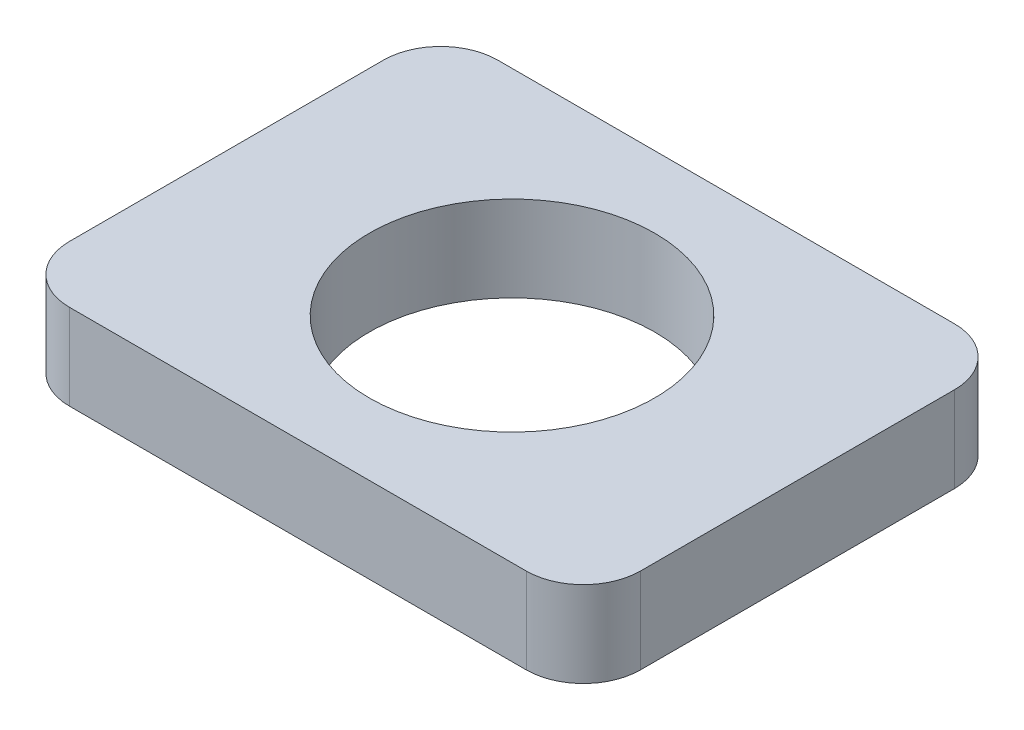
from build123d import *

# Parameters (mm, degrees)
SKETCH1_W           = 20
SKETCH1_H           = 15
SKETCH1_R           = 5
BOSS_EXTRUDE1_DEPTH = 3
FILLET1_R           = 2


with BuildPart() as part:
    # Sketch1 → Boss-Extrude1 (new body)
    with BuildSketch(Plane(origin=(0, 0, 0), x_dir=(1, 0, 0), z_dir=(0, 1, 0))):
        Rectangle(SKETCH1_W, SKETCH1_H)
        with Locations(Location((0, 0, 0), (0, 0, 270))):
            Circle(SKETCH1_R, mode=Mode.SUBTRACT)
    extrude(amount=BOSS_EXTRUDE1_DEPTH)

    # Fillet1
    fillet1_edges = [part.edges().sort_by_distance(p)[0] for p in [
        (10, 1.5, 7.5),
        (-10, 1.5, 7.5),
        (-10, 1.5, -7.5),
        (10, 1.5, -7.5),
    ]]
    fillet(fillet1_edges, radius=FILLET1_R)


solid = part.part
